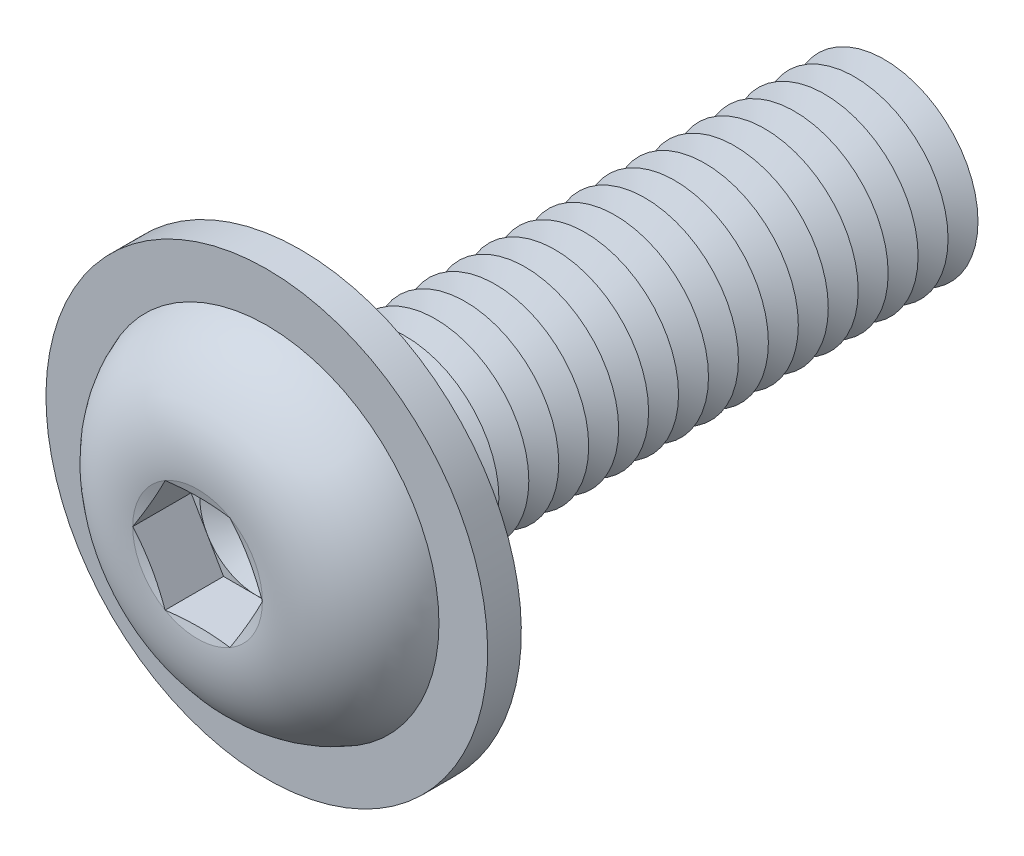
from build123d import *

# Parameters (mm, degrees)
FILLET1_R           = 0.4
LPATTERN1_COUNT     = 20
LPATTERN1_PITCH     = 0.8
CUT_EXTRUDE1_DEPTH  = 1.56
SKETCH5_R           = 5.9
SKETCH5_R_2         = 2.9
BOSS_EXTRUDE1_DEPTH = 0.9


with BuildPart() as part:
    # Sketch1 → Revolve1 (revolve)
    with BuildSketch(Plane(origin=(0, 0, 0), x_dir=(0, 0, -1), z_dir=(1, 0, 0)), mode=Mode.PRIVATE) as revolve1_sk:
        with BuildLine():
            Line((0, 2.5), (0, 4.75))
            ThreePointArc((0, 4.75), (-2.041477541, 3.848329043), (-2.75, 1.73205))
            Line((-2.75, 1.73205), (-2.517949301, 0.866025))
            Line((-2.517949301, 0.866025), (-2.75, 0.866025))
            Line((-2.75, 0.866025), (-2.75, 0))
            Line((-2.75, 0), (16, 0))
            Line((16, 0), (16, 2.5))
            Line((16, 2.5), (0, 2.5))
        make_face()
    revolve(revolve1_sk.sketch.rotate(Axis((0, 0, -16), (0, 0, 1)), 90), axis=Axis((0, 0, -16), (0, 0, 1)))

    # Fillet1
    fillet1_edges = [part.edges().sort_by_distance(p)[0] for p in [
        (2.5, 0, 0),
    ]]
    fillet(fillet1_edges, radius=FILLET1_R)

    # Sketch2 → Cut-Revolve1 (revolve, cut)
    with BuildSketch(Plane(origin=(0, 0, 0), x_dir=(0, 0, -1), z_dir=(1, 0, 0)), mode=Mode.PRIVATE) as cut_revolve1_sk:
        Polygon((15.6, 2.5), (16.4, 2.5), (16, 1.807179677), align=None)
    cut_revolve1 = revolve(cut_revolve1_sk.sketch.rotate(Axis((0, 0, -16), (0, 0, -1)), 270), axis=Axis((0, 0, -16), (0, 0, -1)), mode=Mode.SUBTRACT)

    # LPattern1: Cut-Revolve1 ×20
    with Locations(*[(0, 0, i * LPATTERN1_PITCH) for i in range(1, LPATTERN1_COUNT)]):
        add(cut_revolve1, mode=Mode.SUBTRACT)

    # Sketch3 → Cut-Extrude1 (cut)
    with BuildSketch(Plane.XY.offset(2.75)):
        Polygon((0.866025, 1.499999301), (-0.866025, 1.499999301), (-1.73205, 0), (-0.866025, -1.499999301), (0.866025, -1.499999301), (1.73205, 0), align=None)
    extrude(amount=-CUT_EXTRUDE1_DEPTH, mode=Mode.SUBTRACT)

    # Cut-Extrude2 cone 1 section (on through the dimple's axis) → Cut-Extrude2 (revolve, cut)
    with BuildSketch(Plane(origin=(0, 0, 1.19), x_dir=(0, -1, 0), z_dir=(1, 0, 0))):
        Polygon((0, 0), (1.499999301, 0), (0, 0.866025), align=None)
    revolve(axis=Axis((0, 0, 1.19), (0, 0, -1)), mode=Mode.SUBTRACT)

    # Sketch5 → Boss-Extrude1 (add)
    with BuildSketch(Plane(origin=(0, 0, 0), x_dir=(-1, 0, 0), z_dir=(0, 0, -1))):
        with Locations(Location((0, 0, 0), (0, 0, 90))):
            Circle(SKETCH5_R)
        Circle(SKETCH5_R_2, mode=Mode.SUBTRACT)
    extrude(amount=-BOSS_EXTRUDE1_DEPTH)


solid = part.part
